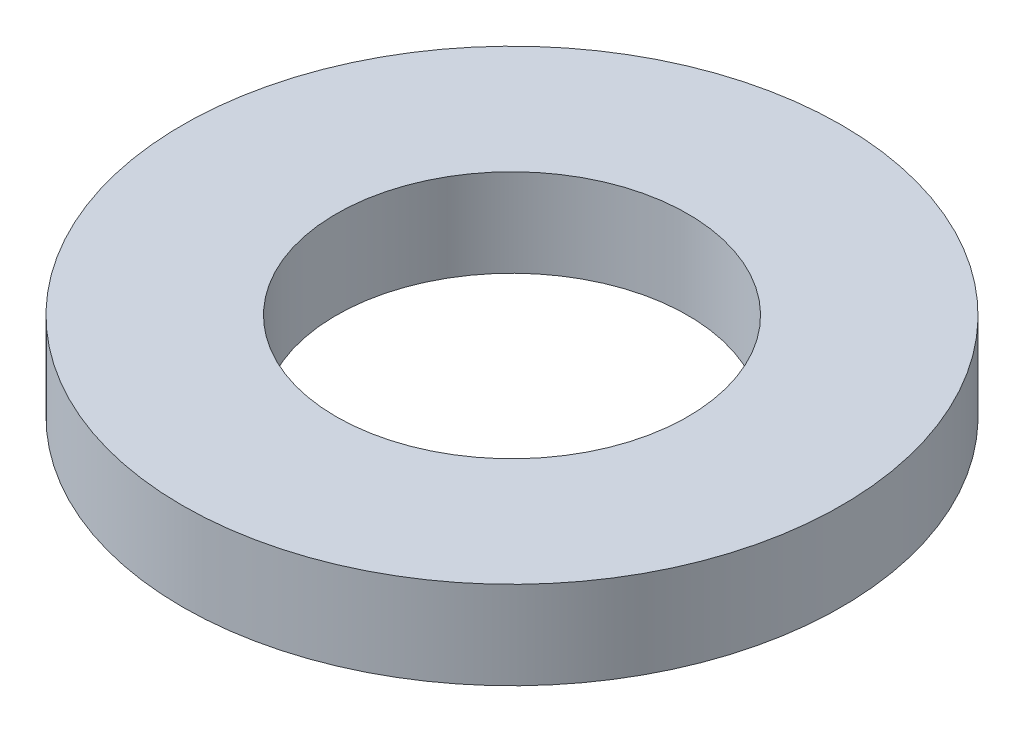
from build123d import *

# Parameters (mm, degrees)
SKETCH1_R      = 6
SKETCH1_R_2    = 3.2
EXTRUDE1_DEPTH = 1.6


with BuildPart() as part:
    # Sketch1 → Extrude1 (new body)
    with BuildSketch(Plane(origin=(0, 0, 0), x_dir=(1, 0, 0), z_dir=(0, 1, 0))):
        with Locations(Location((0, 0, 0), (0, 0, 270))):
            Circle(SKETCH1_R)
        with Locations(Location((0, 0, 0), (0, 0, 270))):
            Circle(SKETCH1_R_2, mode=Mode.SUBTRACT)
    extrude(amount=EXTRUDE1_DEPTH)


solid = part.part
